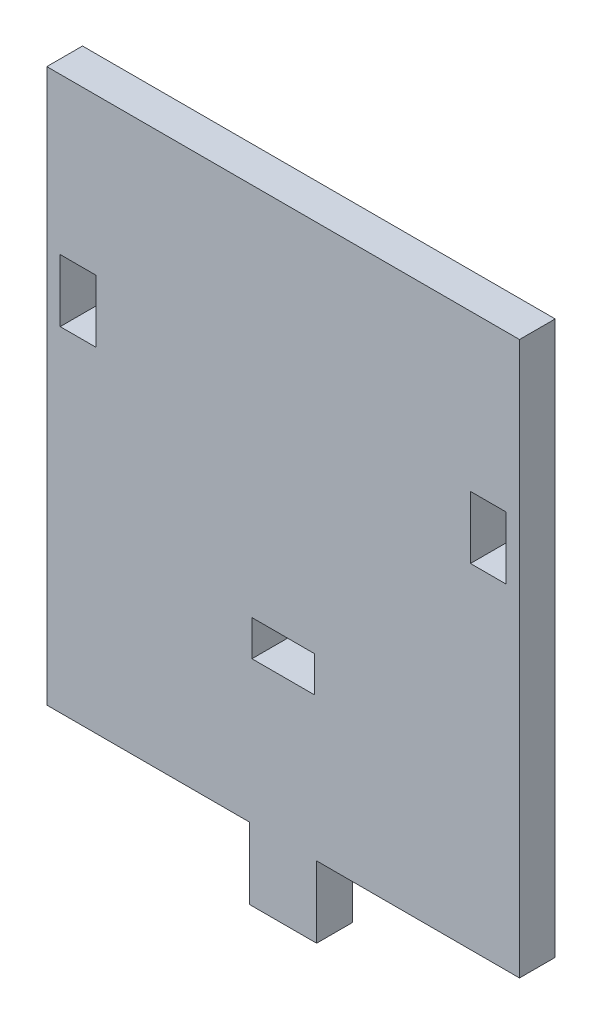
from build123d import *

# Parameters (mm, degrees)
SKETCH1_W           = 4
SKETCH1_H           = 7
SKETCH1_W_2         = 7
SKETCH1_H_2         = 4
BOSS_EXTRUDE3_DEPTH = 4


with BuildPart() as part:
    # Sketch1 → Boss-Extrude3 (new body)
    with BuildSketch(Plane.XY):
        Polygon((-0.298886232, -55.36470609), (-0.298886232, -63.36470609), (-7.798886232, -63.36470609), (-7.798886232, -55.36470609), (-30.548886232, -55.36470609), (-30.548886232, 6.63529391), (22.451113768, 6.63529391), (22.451113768, -55.36470609), align=None)
        with Locations((18.951113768, -14.36470609)):
            Rectangle(SKETCH1_W, SKETCH1_H, mode=Mode.SUBTRACT)
        with Locations((-27.048886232, -14.36470609)):
            Rectangle(SKETCH1_W, SKETCH1_H, mode=Mode.SUBTRACT)
        with Locations((-4.048886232, -37.36470609)):
            Rectangle(SKETCH1_W_2, SKETCH1_H_2, mode=Mode.SUBTRACT)
    extrude(amount=BOSS_EXTRUDE3_DEPTH)


solid = part.part
